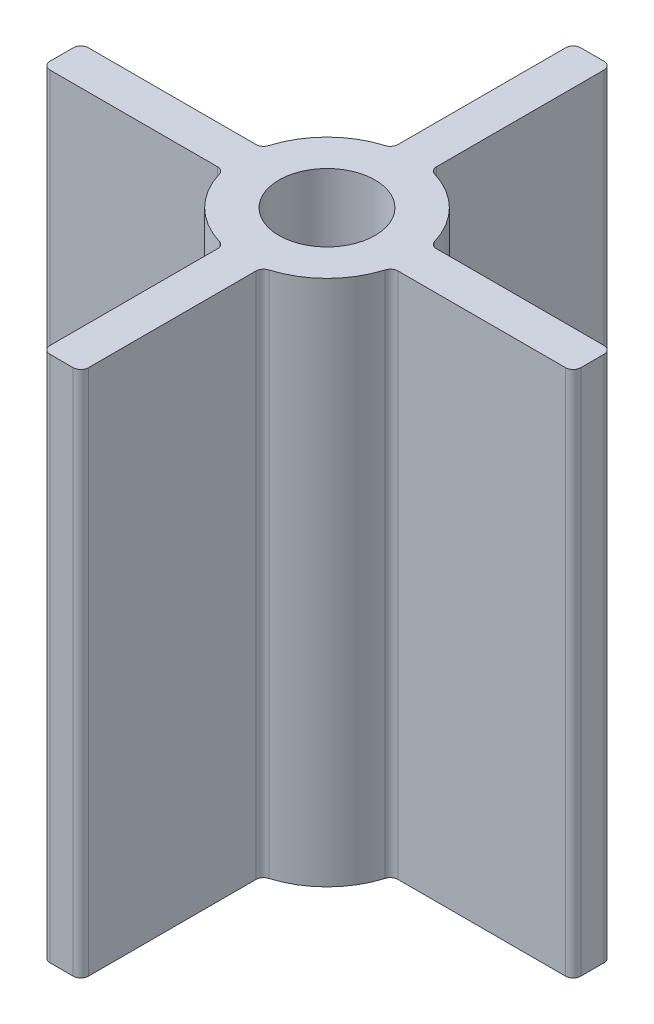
from build123d import *

# Parameters (mm, degrees)
SKETCH1_R           = 11.25
SKETCH1_R_2         = 6.25
BOSS_EXTRUDE1_DEPTH = 34.25
SKETCH2_W           = 5
SKETCH2_H           = 24.25
SKETCH2_W_2         = 24.25
SKETCH2_H_2         = 5
BOSS_EXTRUDE2_DEPTH = 68.5
FILLET1_R           = 1
FILLET2_R           = 1
FILLET3_R           = 1
FILLET4_R           = 1
FILLET5_R           = 1


with BuildPart() as part:
    # Sketch1 → Boss-Extrude1 (new, symmetric)
    with BuildSketch(Plane(origin=(0, 0, 0), x_dir=(1, 0, 0), z_dir=(0, 1, 0))):
        with Locations(Location((0, 0, 0), (0, 0, 270))):
            Circle(SKETCH1_R)
        with Locations(Location((0, 0, 0), (0, 0, 270))):
            Circle(SKETCH1_R_2, mode=Mode.SUBTRACT)
    extrude(amount=BOSS_EXTRUDE1_DEPTH, both=True)

    # Sketch2 → Boss-Extrude2 (add)
    with BuildSketch(Plane(origin=(0, -34.25, 0), x_dir=(-1, 0, 0), z_dir=(0, -1, 0))):
        with Locations((0, -22.375)):
            Rectangle(SKETCH2_W, SKETCH2_H)
        with Locations((-22.375, 0)):
            Rectangle(SKETCH2_W_2, SKETCH2_H_2)
        with Locations((0, 22.375)):
            Rectangle(SKETCH2_W, SKETCH2_H)
        with Locations((22.375, 0)):
            Rectangle(SKETCH2_W_2, SKETCH2_H_2)
    extrude(amount=-BOSS_EXTRUDE2_DEPTH)

    # Fillet1
    fillet1_edges = [part.edges().sort_by_distance(p)[0] for p in [
        (-2.5, 0, 10.968705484),
    ]]
    fillet(fillet1_edges, radius=FILLET1_R)

    # Fillet2
    fillet2_edges = [part.edges().sort_by_distance(p)[0] for p in [
        (2.5, 0, 10.968705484),
        (10.968705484, 0, -2.5),
        (10.968705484, 0, 2.5),
        (-2.5, 0, -10.968705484),
        (2.5, 0, -10.968705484),
        (-10.968705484, 0, 2.5),
        (-10.968705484, 0, -2.5),
    ]]
    fillet(fillet2_edges, radius=FILLET2_R)

    # Fillet3
    fillet3_edges = [part.edges().sort_by_distance(p)[0] for p in [
        (-2.5, 0, 34.5),
    ]]
    fillet(fillet3_edges, radius=FILLET3_R)

    # Fillet4
    fillet4_edges = [part.edges().sort_by_distance(p)[0] for p in [
        (2.5, 0, 34.5),
    ]]
    fillet(fillet4_edges, radius=FILLET4_R)

    # Fillet5
    fillet5_edges = [part.edges().sort_by_distance(p)[0] for p in [
        (34.5, 0, -2.5),
        (34.5, 0, 2.5),
        (-2.5, 0, -34.5),
        (2.5, 0, -34.5),
        (-34.5, 0, 2.5),
        (-34.5, 0, -2.5),
    ]]
    fillet(fillet5_edges, radius=FILLET5_R)


solid = part.part
